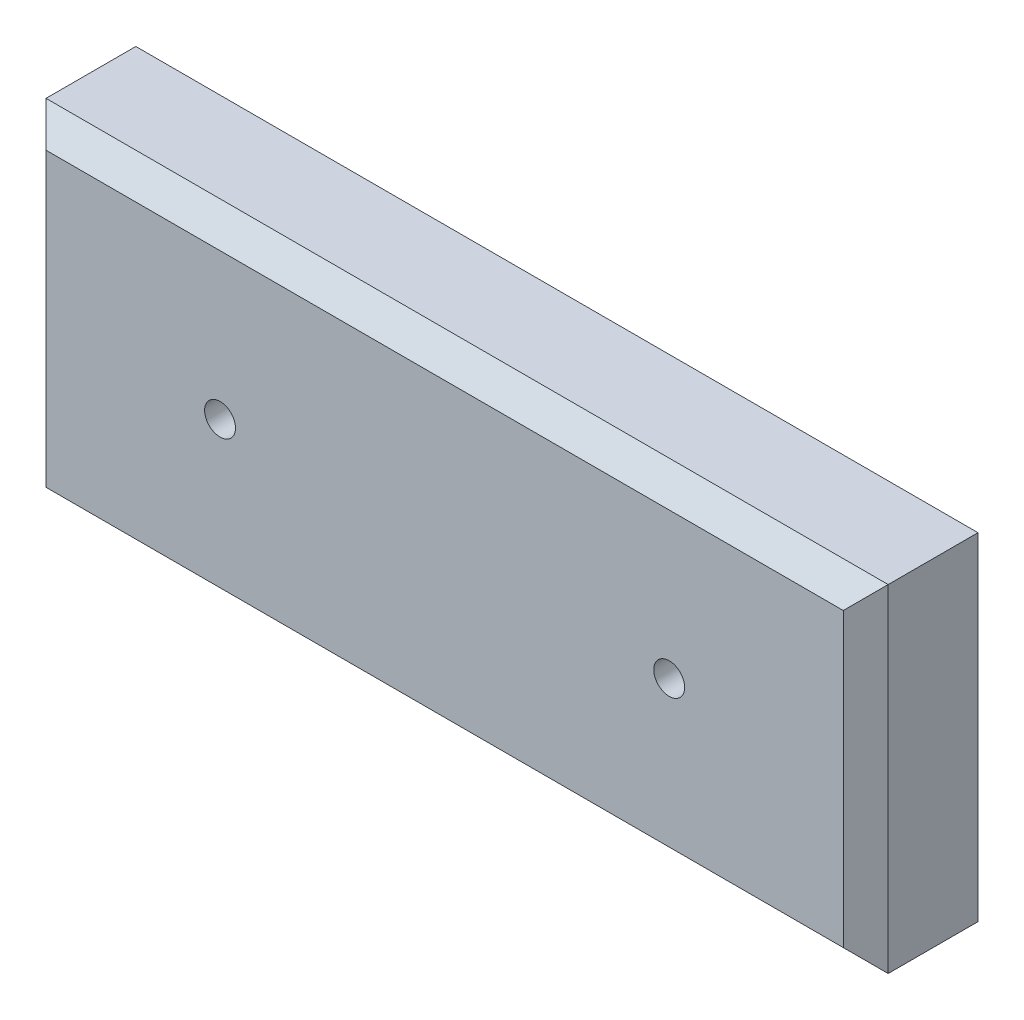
from build123d import *

# Parameters (mm, degrees)
ESQUISSE1_W                                        = 150
ESQUISSE1_H                                        = 60
EXTRUSION1_DEPTH                                   = 20
CHANFREIN1_SIZE                                    = 4
CHAMBRAGE_POUR_VIS_T_TE_HEXAGONALE_M51_D           = 5.5
CHAMBRAGE_POUR_VIS_T_TE_HEXAGONALE_M51_CBORE_D     = 10
CHAMBRAGE_POUR_VIS_T_TE_HEXAGONALE_M51_CBORE_DEPTH = 5


with BuildPart() as part:
    # Esquisse1 → Extrusion1 (new body)
    with BuildSketch(Plane.XY):
        Rectangle(ESQUISSE1_W, ESQUISSE1_H)
    extrude(amount=EXTRUSION1_DEPTH)

    # Chanfrein1
    chanfrein1_edges = [part.edges().sort_by_distance(p)[0] for p in [
        (0, 30, 20),
        (-75, 0, 20),
        (0, -30, 20),
        (75, 0, 20),
    ]]
    chamfer(chanfrein1_edges, length=CHANFREIN1_SIZE)

    # Chambrage pour vis _ t_te hexagonale M51 (through all)
    with Locations(Plane(origin=(0, 0, 0), x_dir=(-1, 0, 0), z_dir=(0, 0, -1))):
        with Locations((-40, 0), (40, 0)):
            CounterBoreHole(CHAMBRAGE_POUR_VIS_T_TE_HEXAGONALE_M51_D / 2, CHAMBRAGE_POUR_VIS_T_TE_HEXAGONALE_M51_CBORE_D / 2, CHAMBRAGE_POUR_VIS_T_TE_HEXAGONALE_M51_CBORE_DEPTH)


solid = part.part
